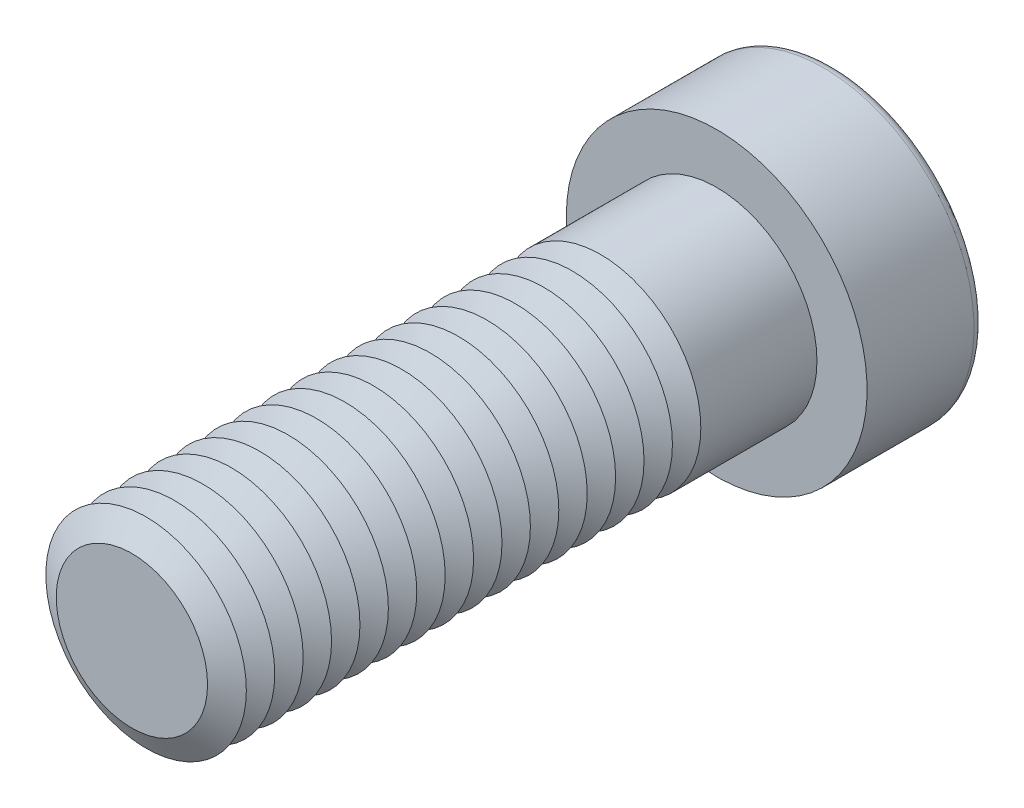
ISO-10303-21;
HEADER;
FILE_DESCRIPTION(('STEP AP214'),'2;1');
FILE_NAME('part.step','',(''),(''),'','','');
FILE_SCHEMA(('AUTOMOTIVE_DESIGN { 1 0 10303 214 1 1 1 1 }'));
ENDSEC;
DATA;
#1=APPLICATION_CONTEXT('core data for automotive mechanical design processes');
#2=APPLICATION_PROTOCOL_DEFINITION('international standard','automotive_design',2000,#1);
#3=PRODUCT_CONTEXT('',#1,'mechanical');
#4=PRODUCT('Part','Part','',(#3));
#5=PRODUCT_RELATED_PRODUCT_CATEGORY('part','',(#4));
#6=PRODUCT_DEFINITION_FORMATION('','',#4);
#7=PRODUCT_DEFINITION_CONTEXT('part definition',#1,'design');
#8=PRODUCT_DEFINITION('design','',#6,#7);
#9=PRODUCT_DEFINITION_SHAPE('','',#8);
#10=(LENGTH_UNIT() NAMED_UNIT(*) SI_UNIT(.MILLI.,.METRE.));
#11=(NAMED_UNIT(*) PLANE_ANGLE_UNIT() SI_UNIT($,.RADIAN.));
#12=(NAMED_UNIT(*) SI_UNIT($,.STERADIAN.) SOLID_ANGLE_UNIT());
#13=UNCERTAINTY_MEASURE_WITH_UNIT(LENGTH_MEASURE(1.E-05),#10,'distance_accuracy_value','');
#14=(GEOMETRIC_REPRESENTATION_CONTEXT(3) GLOBAL_UNCERTAINTY_ASSIGNED_CONTEXT((#13)) GLOBAL_UNIT_ASSIGNED_CONTEXT((#10,
#11,#12)) REPRESENTATION_CONTEXT('',''));
#15=CARTESIAN_POINT('',(0.,0.,0.));
#16=DIRECTION('',(0.,0.,1.));
#17=DIRECTION('',(1.,0.,0.));
#18=AXIS2_PLACEMENT_3D('',#15,#16,#17);
#19=CARTESIAN_POINT('',(0.,0.,29.05));
#20=DIRECTION('',(0.,0.,1.));
#21=DIRECTION('',(1.,0.,0.));
#22=AXIS2_PLACEMENT_3D('',#19,#20,#21);
#23=CONICAL_SURFACE('',#22,6.,1.0471975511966);
#24=CARTESIAN_POINT('',(0.,0.,28.2));
#25=DIRECTION('',(0.,0.,1.));
#26=DIRECTION('',(1.,0.,0.));
#27=AXIS2_PLACEMENT_3D('',#24,#25,#26);
#28=CIRCLE('',#27,4.52775681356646);
#29=CARTESIAN_POINT('',(4.52775681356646,0.,28.2));
#30=VERTEX_POINT('',#29);
#31=EDGE_CURVE('E313',#30,#30,#28,.T.);
#32=ORIENTED_EDGE('',*,*,#31,.T.);
#33=EDGE_LOOP('',(#32));
#34=FACE_BOUND('',#33,.T.);
#35=CARTESIAN_POINT('',(0.,0.,29.05));
#36=DIRECTION('',(0.,0.,1.));
#37=DIRECTION('',(1.,0.,0.));
#38=AXIS2_PLACEMENT_3D('',#35,#36,#37);
#39=CIRCLE('',#38,6.);
#40=CARTESIAN_POINT('',(6.,0.,29.05));
#41=VERTEX_POINT('',#40);
#42=EDGE_CURVE('E316',#41,#41,#39,.T.);
#43=ORIENTED_EDGE('',*,*,#42,.F.);
#44=EDGE_LOOP('',(#43));
#45=FACE_BOUND('',#44,.T.);
#46=ADVANCED_FACE('F39',(#34,#45),#23,.T.);
#47=CARTESIAN_POINT('',(0.,0.,28.2));
#48=DIRECTION('',(0.,0.,-1.));
#49=DIRECTION('',(-1.,0.,0.));
#50=AXIS2_PLACEMENT_3D('',#47,#48,#49);
#51=CONICAL_SURFACE('',#50,4.52775681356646,1.0471975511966);
#52=CARTESIAN_POINT('',(0.,0.,27.35));
#53=DIRECTION('',(0.,0.,1.));
#54=DIRECTION('',(1.,0.,0.));
#55=AXIS2_PLACEMENT_3D('',#52,#53,#54);
#56=CIRCLE('',#55,6.);
#57=CARTESIAN_POINT('',(6.,0.,27.35));
#58=VERTEX_POINT('',#57);
#59=EDGE_CURVE('E324',#58,#58,#56,.T.);
#60=ORIENTED_EDGE('',*,*,#59,.T.);
#61=EDGE_LOOP('',(#60));
#62=FACE_BOUND('',#61,.T.);
#63=ORIENTED_EDGE('',*,*,#31,.F.);
#64=EDGE_LOOP('',(#63));
#65=FACE_BOUND('',#64,.T.);
#66=ADVANCED_FACE('F245',(#62,#65),#51,.T.);
#67=CARTESIAN_POINT('',(0.,0.,35.));
#68=DIRECTION('',(0.,0.,1.));
#69=DIRECTION('',(1.,0.,0.));
#70=AXIS2_PLACEMENT_3D('',#67,#68,#69);
#71=PLANE('',#70);
#72=CARTESIAN_POINT('',(0.,0.,35.));
#73=DIRECTION('',(0.,0.,1.));
#74=DIRECTION('',(1.,0.,0.));
#75=AXIS2_PLACEMENT_3D('',#72,#73,#74);
#76=CIRCLE('',#75,4.52775681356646);
#77=CARTESIAN_POINT('',(4.52775681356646,0.,35.));
#78=VERTEX_POINT('',#77);
#79=EDGE_CURVE('E174',#78,#78,#76,.T.);
#80=ORIENTED_EDGE('',*,*,#79,.T.);
#81=EDGE_LOOP('',(#80));
#82=FACE_BOUND('',#81,.T.);
#83=ADVANCED_FACE('F251',(#82),#71,.T.);
#84=CARTESIAN_POINT('',(0.,0.,35.));
#85=DIRECTION('',(0.,0.,-1.));
#86=DIRECTION('',(-1.,0.,0.));
#87=AXIS2_PLACEMENT_3D('',#84,#85,#86);
#88=CONICAL_SURFACE('',#87,4.52775681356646,1.0471975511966);
#89=CARTESIAN_POINT('',(0.,0.,34.15));
#90=DIRECTION('',(0.,0.,1.));
#91=DIRECTION('',(1.,0.,0.));
#92=AXIS2_PLACEMENT_3D('',#89,#90,#91);
#93=CIRCLE('',#92,6.);
#94=CARTESIAN_POINT('',(6.,0.,34.15));
#95=VERTEX_POINT('',#94);
#96=EDGE_CURVE('E291',#95,#95,#93,.T.);
#97=ORIENTED_EDGE('',*,*,#96,.T.);
#98=EDGE_LOOP('',(#97));
#99=FACE_BOUND('',#98,.T.);
#100=ORIENTED_EDGE('',*,*,#79,.F.);
#101=EDGE_LOOP('',(#100));
#102=FACE_BOUND('',#101,.T.);
#103=ADVANCED_FACE('F199',(#99,#102),#88,.T.);
#104=CARTESIAN_POINT('',(0.,0.,34.15));
#105=DIRECTION('',(0.,0.,1.));
#106=DIRECTION('',(1.,0.,0.));
#107=AXIS2_PLACEMENT_3D('',#104,#105,#106);
#108=CONICAL_SURFACE('',#107,6.,1.0471975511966);
#109=CARTESIAN_POINT('',(0.,0.,33.3));
#110=DIRECTION('',(0.,0.,1.));
#111=DIRECTION('',(1.,0.,0.));
#112=AXIS2_PLACEMENT_3D('',#109,#110,#111);
#113=CIRCLE('',#112,4.52775681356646);
#114=CARTESIAN_POINT('',(4.52775681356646,0.,33.3));
#115=VERTEX_POINT('',#114);
#116=EDGE_CURVE('E288',#115,#115,#113,.T.);
#117=ORIENTED_EDGE('',*,*,#116,.T.);
#118=EDGE_LOOP('',(#117));
#119=FACE_BOUND('',#118,.T.);
#120=ORIENTED_EDGE('',*,*,#96,.F.);
#121=EDGE_LOOP('',(#120));
#122=FACE_BOUND('',#121,.T.);
#123=ADVANCED_FACE('F277',(#119,#122),#108,.T.);
#124=CARTESIAN_POINT('',(0.,0.,33.3));
#125=DIRECTION('',(0.,0.,-1.));
#126=DIRECTION('',(-1.,0.,0.));
#127=AXIS2_PLACEMENT_3D('',#124,#125,#126);
#128=CONICAL_SURFACE('',#127,4.52775681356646,1.0471975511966);
#129=CARTESIAN_POINT('',(0.,0.,32.45));
#130=DIRECTION('',(0.,0.,1.));
#131=DIRECTION('',(1.,0.,0.));
#132=AXIS2_PLACEMENT_3D('',#129,#130,#131);
#133=CIRCLE('',#132,6.);
#134=CARTESIAN_POINT('',(6.,0.,32.45));
#135=VERTEX_POINT('',#134);
#136=EDGE_CURVE('E299',#135,#135,#133,.T.);
#137=ORIENTED_EDGE('',*,*,#136,.T.);
#138=EDGE_LOOP('',(#137));
#139=FACE_BOUND('',#138,.T.);
#140=ORIENTED_EDGE('',*,*,#116,.F.);
#141=EDGE_LOOP('',(#140));
#142=FACE_BOUND('',#141,.T.);
#143=ADVANCED_FACE('F274',(#139,#142),#128,.T.);
#144=CARTESIAN_POINT('',(0.,0.,32.45));
#145=DIRECTION('',(0.,0.,1.));
#146=DIRECTION('',(1.,0.,0.));
#147=AXIS2_PLACEMENT_3D('',#144,#145,#146);
#148=CONICAL_SURFACE('',#147,6.,1.0471975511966);
#149=CARTESIAN_POINT('',(0.,0.,31.6));
#150=DIRECTION('',(0.,0.,1.));
#151=DIRECTION('',(1.,0.,0.));
#152=AXIS2_PLACEMENT_3D('',#149,#150,#151);
#153=CIRCLE('',#152,4.52775681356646);
#154=CARTESIAN_POINT('',(4.52775681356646,0.,31.6));
#155=VERTEX_POINT('',#154);
#156=EDGE_CURVE('E293',#155,#155,#153,.T.);
#157=ORIENTED_EDGE('',*,*,#156,.T.);
#158=EDGE_LOOP('',(#157));
#159=FACE_BOUND('',#158,.T.);
#160=ORIENTED_EDGE('',*,*,#136,.F.);
#161=EDGE_LOOP('',(#160));
#162=FACE_BOUND('',#161,.T.);
#163=ADVANCED_FACE('F270',(#159,#162),#148,.T.);
#164=CARTESIAN_POINT('',(0.,0.,31.6));
#165=DIRECTION('',(0.,0.,-1.));
#166=DIRECTION('',(-1.,0.,0.));
#167=AXIS2_PLACEMENT_3D('',#164,#165,#166);
#168=CONICAL_SURFACE('',#167,4.52775681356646,1.0471975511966);
#169=CARTESIAN_POINT('',(0.,0.,30.75));
#170=DIRECTION('',(0.,0.,1.));
#171=DIRECTION('',(1.,0.,0.));
#172=AXIS2_PLACEMENT_3D('',#169,#170,#171);
#173=CIRCLE('',#172,6.);
#174=CARTESIAN_POINT('',(6.,0.,30.75));
#175=VERTEX_POINT('',#174);
#176=EDGE_CURVE('E309',#175,#175,#173,.T.);
#177=ORIENTED_EDGE('',*,*,#176,.T.);
#178=EDGE_LOOP('',(#177));
#179=FACE_BOUND('',#178,.T.);
#180=ORIENTED_EDGE('',*,*,#156,.F.);
#181=EDGE_LOOP('',(#180));
#182=FACE_BOUND('',#181,.T.);
#183=ADVANCED_FACE('F266',(#179,#182),#168,.T.);
#184=CARTESIAN_POINT('',(0.,0.,30.75));
#185=DIRECTION('',(0.,0.,1.));
#186=DIRECTION('',(1.,0.,0.));
#187=AXIS2_PLACEMENT_3D('',#184,#185,#186);
#188=CONICAL_SURFACE('',#187,6.,1.0471975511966);
#189=CARTESIAN_POINT('',(0.,0.,29.9));
#190=DIRECTION('',(0.,0.,1.));
#191=DIRECTION('',(1.,0.,0.));
#192=AXIS2_PLACEMENT_3D('',#189,#190,#191);
#193=CIRCLE('',#192,4.52775681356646);
#194=CARTESIAN_POINT('',(4.52775681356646,0.,29.9));
#195=VERTEX_POINT('',#194);
#196=EDGE_CURVE('E305',#195,#195,#193,.T.);
#197=ORIENTED_EDGE('',*,*,#196,.T.);
#198=EDGE_LOOP('',(#197));
#199=FACE_BOUND('',#198,.T.);
#200=ORIENTED_EDGE('',*,*,#176,.F.);
#201=EDGE_LOOP('',(#200));
#202=FACE_BOUND('',#201,.T.);
#203=ADVANCED_FACE('F262',(#199,#202),#188,.T.);
#204=CARTESIAN_POINT('',(0.,0.,29.9));
#205=DIRECTION('',(0.,0.,-1.));
#206=DIRECTION('',(-1.,0.,0.));
#207=AXIS2_PLACEMENT_3D('',#204,#205,#206);
#208=CONICAL_SURFACE('',#207,4.52775681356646,1.0471975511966);
#209=ORIENTED_EDGE('',*,*,#42,.T.);
#210=EDGE_LOOP('',(#209));
#211=FACE_BOUND('',#210,.T.);
#212=ORIENTED_EDGE('',*,*,#196,.F.);
#213=EDGE_LOOP('',(#212));
#214=FACE_BOUND('',#213,.T.);
#215=ADVANCED_FACE('F258',(#211,#214),#208,.T.);
#216=CARTESIAN_POINT('',(0.,0.,27.35));
#217=DIRECTION('',(0.,0.,1.));
#218=DIRECTION('',(1.,0.,0.));
#219=AXIS2_PLACEMENT_3D('',#216,#217,#218);
#220=CONICAL_SURFACE('',#219,6.,1.0471975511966);
#221=CARTESIAN_POINT('',(0.,0.,26.5));
#222=DIRECTION('',(0.,0.,1.));
#223=DIRECTION('',(1.,0.,0.));
#224=AXIS2_PLACEMENT_3D('',#221,#222,#223);
#225=CIRCLE('',#224,4.52775681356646);
#226=CARTESIAN_POINT('',(4.52775681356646,0.,26.5));
#227=VERTEX_POINT('',#226);
#228=EDGE_CURVE('E320',#227,#227,#225,.T.);
#229=ORIENTED_EDGE('',*,*,#228,.T.);
#230=EDGE_LOOP('',(#229));
#231=FACE_BOUND('',#230,.T.);
#232=ORIENTED_EDGE('',*,*,#59,.F.);
#233=EDGE_LOOP('',(#232));
#234=FACE_BOUND('',#233,.T.);
#235=ADVANCED_FACE('F261',(#231,#234),#220,.T.);
#236=CARTESIAN_POINT('',(0.,0.,26.5));
#237=DIRECTION('',(0.,0.,-1.));
#238=DIRECTION('',(-1.,0.,0.));
#239=AXIS2_PLACEMENT_3D('',#236,#237,#238);
#240=CONICAL_SURFACE('',#239,4.52775681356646,1.0471975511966);
#241=CARTESIAN_POINT('',(0.,0.,25.65));
#242=DIRECTION('',(0.,0.,1.));
#243=DIRECTION('',(1.,0.,0.));
#244=AXIS2_PLACEMENT_3D('',#241,#242,#243);
#245=CIRCLE('',#244,6.);
#246=CARTESIAN_POINT('',(6.,0.,25.65));
#247=VERTEX_POINT('',#246);
#248=EDGE_CURVE('E332',#247,#247,#245,.T.);
#249=ORIENTED_EDGE('',*,*,#248,.T.);
#250=EDGE_LOOP('',(#249));
#251=FACE_BOUND('',#250,.T.);
#252=ORIENTED_EDGE('',*,*,#228,.F.);
#253=EDGE_LOOP('',(#252));
#254=FACE_BOUND('',#253,.T.);
#255=ADVANCED_FACE('F511',(#251,#254),#240,.T.);
#256=CARTESIAN_POINT('',(0.,0.,25.65));
#257=DIRECTION('',(0.,0.,1.));
#258=DIRECTION('',(1.,0.,0.));
#259=AXIS2_PLACEMENT_3D('',#256,#257,#258);
#260=CONICAL_SURFACE('',#259,6.,1.0471975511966);
#261=CARTESIAN_POINT('',(0.,0.,24.8));
#262=DIRECTION('',(0.,0.,1.));
#263=DIRECTION('',(1.,0.,0.));
#264=AXIS2_PLACEMENT_3D('',#261,#262,#263);
#265=CIRCLE('',#264,4.52775681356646);
#266=CARTESIAN_POINT('',(4.52775681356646,0.,24.8));
#267=VERTEX_POINT('',#266);
#268=EDGE_CURVE('E328',#267,#267,#265,.T.);
#269=ORIENTED_EDGE('',*,*,#268,.T.);
#270=EDGE_LOOP('',(#269));
#271=FACE_BOUND('',#270,.T.);
#272=ORIENTED_EDGE('',*,*,#248,.F.);
#273=EDGE_LOOP('',(#272));
#274=FACE_BOUND('',#273,.T.);
#275=ADVANCED_FACE('F507',(#271,#274),#260,.T.);
#276=CARTESIAN_POINT('',(0.,0.,24.8));
#277=DIRECTION('',(0.,0.,-1.));
#278=DIRECTION('',(-1.,0.,0.));
#279=AXIS2_PLACEMENT_3D('',#276,#277,#278);
#280=CONICAL_SURFACE('',#279,4.52775681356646,1.0471975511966);
#281=CARTESIAN_POINT('',(0.,0.,23.95));
#282=DIRECTION('',(0.,0.,1.));
#283=DIRECTION('',(1.,0.,0.));
#284=AXIS2_PLACEMENT_3D('',#281,#282,#283);
#285=CIRCLE('',#284,6.);
#286=CARTESIAN_POINT('',(6.,0.,23.95));
#287=VERTEX_POINT('',#286);
#288=EDGE_CURVE('E340',#287,#287,#285,.T.);
#289=ORIENTED_EDGE('',*,*,#288,.T.);
#290=EDGE_LOOP('',(#289));
#291=FACE_BOUND('',#290,.T.);
#292=ORIENTED_EDGE('',*,*,#268,.F.);
#293=EDGE_LOOP('',(#292));
#294=FACE_BOUND('',#293,.T.);
#295=ADVANCED_FACE('F503',(#291,#294),#280,.T.);
#296=CARTESIAN_POINT('',(0.,0.,23.95));
#297=DIRECTION('',(0.,0.,1.));
#298=DIRECTION('',(1.,0.,0.));
#299=AXIS2_PLACEMENT_3D('',#296,#297,#298);
#300=CONICAL_SURFACE('',#299,6.,1.0471975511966);
#301=CARTESIAN_POINT('',(0.,0.,23.1));
#302=DIRECTION('',(0.,0.,1.));
#303=DIRECTION('',(1.,0.,0.));
#304=AXIS2_PLACEMENT_3D('',#301,#302,#303);
#305=CIRCLE('',#304,4.52775681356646);
#306=CARTESIAN_POINT('',(4.52775681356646,0.,23.1));
#307=VERTEX_POINT('',#306);
#308=EDGE_CURVE('E336',#307,#307,#305,.T.);
#309=ORIENTED_EDGE('',*,*,#308,.T.);
#310=EDGE_LOOP('',(#309));
#311=FACE_BOUND('',#310,.T.);
#312=ORIENTED_EDGE('',*,*,#288,.F.);
#313=EDGE_LOOP('',(#312));
#314=FACE_BOUND('',#313,.T.);
#315=ADVANCED_FACE('F499',(#311,#314),#300,.T.);
#316=CARTESIAN_POINT('',(0.,0.,23.1));
#317=DIRECTION('',(0.,0.,-1.));
#318=DIRECTION('',(-1.,0.,0.));
#319=AXIS2_PLACEMENT_3D('',#316,#317,#318);
#320=CONICAL_SURFACE('',#319,4.52775681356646,1.0471975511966);
#321=CARTESIAN_POINT('',(0.,0.,22.25));
#322=DIRECTION('',(0.,0.,1.));
#323=DIRECTION('',(1.,0.,0.));
#324=AXIS2_PLACEMENT_3D('',#321,#322,#323);
#325=CIRCLE('',#324,6.);
#326=CARTESIAN_POINT('',(6.,0.,22.25));
#327=VERTEX_POINT('',#326);
#328=EDGE_CURVE('E348',#327,#327,#325,.T.);
#329=ORIENTED_EDGE('',*,*,#328,.T.);
#330=EDGE_LOOP('',(#329));
#331=FACE_BOUND('',#330,.T.);
#332=ORIENTED_EDGE('',*,*,#308,.F.);
#333=EDGE_LOOP('',(#332));
#334=FACE_BOUND('',#333,.T.);
#335=ADVANCED_FACE('F495',(#331,#334),#320,.T.);
#336=CARTESIAN_POINT('',(0.,0.,22.25));
#337=DIRECTION('',(0.,0.,1.));
#338=DIRECTION('',(1.,0.,0.));
#339=AXIS2_PLACEMENT_3D('',#336,#337,#338);
#340=CONICAL_SURFACE('',#339,6.,1.0471975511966);
#341=CARTESIAN_POINT('',(0.,0.,21.4));
#342=DIRECTION('',(0.,0.,1.));
#343=DIRECTION('',(1.,0.,0.));
#344=AXIS2_PLACEMENT_3D('',#341,#342,#343);
#345=CIRCLE('',#344,4.52775681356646);
#346=CARTESIAN_POINT('',(4.52775681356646,0.,21.4));
#347=VERTEX_POINT('',#346);
#348=EDGE_CURVE('E344',#347,#347,#345,.T.);
#349=ORIENTED_EDGE('',*,*,#348,.T.);
#350=EDGE_LOOP('',(#349));
#351=FACE_BOUND('',#350,.T.);
#352=ORIENTED_EDGE('',*,*,#328,.F.);
#353=EDGE_LOOP('',(#352));
#354=FACE_BOUND('',#353,.T.);
#355=ADVANCED_FACE('F491',(#351,#354),#340,.T.);
#356=CARTESIAN_POINT('',(0.,0.,21.4));
#357=DIRECTION('',(0.,0.,-1.));
#358=DIRECTION('',(-1.,0.,0.));
#359=AXIS2_PLACEMENT_3D('',#356,#357,#358);
#360=CONICAL_SURFACE('',#359,4.52775681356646,1.0471975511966);
#361=CARTESIAN_POINT('',(0.,0.,20.55));
#362=DIRECTION('',(0.,0.,1.));
#363=DIRECTION('',(1.,0.,0.));
#364=AXIS2_PLACEMENT_3D('',#361,#362,#363);
#365=CIRCLE('',#364,6.);
#366=CARTESIAN_POINT('',(6.,0.,20.55));
#367=VERTEX_POINT('',#366);
#368=EDGE_CURVE('E356',#367,#367,#365,.T.);
#369=ORIENTED_EDGE('',*,*,#368,.T.);
#370=EDGE_LOOP('',(#369));
#371=FACE_BOUND('',#370,.T.);
#372=ORIENTED_EDGE('',*,*,#348,.F.);
#373=EDGE_LOOP('',(#372));
#374=FACE_BOUND('',#373,.T.);
#375=ADVANCED_FACE('F487',(#371,#374),#360,.T.);
#376=CARTESIAN_POINT('',(0.,0.,20.55));
#377=DIRECTION('',(0.,0.,1.));
#378=DIRECTION('',(1.,0.,0.));
#379=AXIS2_PLACEMENT_3D('',#376,#377,#378);
#380=CONICAL_SURFACE('',#379,6.,1.0471975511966);
#381=CARTESIAN_POINT('',(0.,0.,19.7));
#382=DIRECTION('',(0.,0.,1.));
#383=DIRECTION('',(1.,0.,0.));
#384=AXIS2_PLACEMENT_3D('',#381,#382,#383);
#385=CIRCLE('',#384,4.52775681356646);
#386=CARTESIAN_POINT('',(4.52775681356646,0.,19.7));
#387=VERTEX_POINT('',#386);
#388=EDGE_CURVE('E352',#387,#387,#385,.T.);
#389=ORIENTED_EDGE('',*,*,#388,.T.);
#390=EDGE_LOOP('',(#389));
#391=FACE_BOUND('',#390,.T.);
#392=ORIENTED_EDGE('',*,*,#368,.F.);
#393=EDGE_LOOP('',(#392));
#394=FACE_BOUND('',#393,.T.);
#395=ADVANCED_FACE('F483',(#391,#394),#380,.T.);
#396=CARTESIAN_POINT('',(0.,0.,19.7));
#397=DIRECTION('',(0.,0.,-1.));
#398=DIRECTION('',(-1.,0.,0.));
#399=AXIS2_PLACEMENT_3D('',#396,#397,#398);
#400=CONICAL_SURFACE('',#399,4.52775681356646,1.0471975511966);
#401=CARTESIAN_POINT('',(0.,0.,18.85));
#402=DIRECTION('',(0.,0.,1.));
#403=DIRECTION('',(1.,0.,0.));
#404=AXIS2_PLACEMENT_3D('',#401,#402,#403);
#405=CIRCLE('',#404,6.);
#406=CARTESIAN_POINT('',(6.,0.,18.85));
#407=VERTEX_POINT('',#406);
#408=EDGE_CURVE('E364',#407,#407,#405,.T.);
#409=ORIENTED_EDGE('',*,*,#408,.T.);
#410=EDGE_LOOP('',(#409));
#411=FACE_BOUND('',#410,.T.);
#412=ORIENTED_EDGE('',*,*,#388,.F.);
#413=EDGE_LOOP('',(#412));
#414=FACE_BOUND('',#413,.T.);
#415=ADVANCED_FACE('F479',(#411,#414),#400,.T.);
#416=CARTESIAN_POINT('',(0.,0.,18.85));
#417=DIRECTION('',(0.,0.,1.));
#418=DIRECTION('',(1.,0.,0.));
#419=AXIS2_PLACEMENT_3D('',#416,#417,#418);
#420=CONICAL_SURFACE('',#419,6.,1.0471975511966);
#421=CARTESIAN_POINT('',(0.,0.,18.));
#422=DIRECTION('',(0.,0.,1.));
#423=DIRECTION('',(1.,0.,0.));
#424=AXIS2_PLACEMENT_3D('',#421,#422,#423);
#425=CIRCLE('',#424,4.52775681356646);
#426=CARTESIAN_POINT('',(4.52775681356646,0.,18.));
#427=VERTEX_POINT('',#426);
#428=EDGE_CURVE('E360',#427,#427,#425,.T.);
#429=ORIENTED_EDGE('',*,*,#428,.T.);
#430=EDGE_LOOP('',(#429));
#431=FACE_BOUND('',#430,.T.);
#432=ORIENTED_EDGE('',*,*,#408,.F.);
#433=EDGE_LOOP('',(#432));
#434=FACE_BOUND('',#433,.T.);
#435=ADVANCED_FACE('F475',(#431,#434),#420,.T.);
#436=CARTESIAN_POINT('',(0.,0.,18.));
#437=DIRECTION('',(0.,0.,-1.));
#438=DIRECTION('',(-1.,0.,0.));
#439=AXIS2_PLACEMENT_3D('',#436,#437,#438);
#440=CONICAL_SURFACE('',#439,4.52775681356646,1.0471975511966);
#441=CARTESIAN_POINT('',(0.,0.,17.15));
#442=DIRECTION('',(0.,0.,1.));
#443=DIRECTION('',(1.,0.,0.));
#444=AXIS2_PLACEMENT_3D('',#441,#442,#443);
#445=CIRCLE('',#444,6.);
#446=CARTESIAN_POINT('',(6.,0.,17.15));
#447=VERTEX_POINT('',#446);
#448=EDGE_CURVE('E372',#447,#447,#445,.T.);
#449=ORIENTED_EDGE('',*,*,#448,.T.);
#450=EDGE_LOOP('',(#449));
#451=FACE_BOUND('',#450,.T.);
#452=ORIENTED_EDGE('',*,*,#428,.F.);
#453=EDGE_LOOP('',(#452));
#454=FACE_BOUND('',#453,.T.);
#455=ADVANCED_FACE('F471',(#451,#454),#440,.T.);
#456=CARTESIAN_POINT('',(0.,0.,17.15));
#457=DIRECTION('',(0.,0.,1.));
#458=DIRECTION('',(1.,0.,0.));
#459=AXIS2_PLACEMENT_3D('',#456,#457,#458);
#460=CONICAL_SURFACE('',#459,6.,1.0471975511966);
#461=CARTESIAN_POINT('',(0.,0.,16.3));
#462=DIRECTION('',(0.,0.,1.));
#463=DIRECTION('',(1.,0.,0.));
#464=AXIS2_PLACEMENT_3D('',#461,#462,#463);
#465=CIRCLE('',#464,4.52775681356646);
#466=CARTESIAN_POINT('',(4.52775681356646,0.,16.3));
#467=VERTEX_POINT('',#466);
#468=EDGE_CURVE('E368',#467,#467,#465,.T.);
#469=ORIENTED_EDGE('',*,*,#468,.T.);
#470=EDGE_LOOP('',(#469));
#471=FACE_BOUND('',#470,.T.);
#472=ORIENTED_EDGE('',*,*,#448,.F.);
#473=EDGE_LOOP('',(#472));
#474=FACE_BOUND('',#473,.T.);
#475=ADVANCED_FACE('F467',(#471,#474),#460,.T.);
#476=CARTESIAN_POINT('',(0.,0.,16.3));
#477=DIRECTION('',(0.,0.,-1.));
#478=DIRECTION('',(-1.,0.,0.));
#479=AXIS2_PLACEMENT_3D('',#476,#477,#478);
#480=CONICAL_SURFACE('',#479,4.52775681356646,1.0471975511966);
#481=CARTESIAN_POINT('',(0.,0.,15.45));
#482=DIRECTION('',(0.,0.,1.));
#483=DIRECTION('',(1.,0.,0.));
#484=AXIS2_PLACEMENT_3D('',#481,#482,#483);
#485=CIRCLE('',#484,6.);
#486=CARTESIAN_POINT('',(6.,0.,15.45));
#487=VERTEX_POINT('',#486);
#488=EDGE_CURVE('E380',#487,#487,#485,.T.);
#489=ORIENTED_EDGE('',*,*,#488,.T.);
#490=EDGE_LOOP('',(#489));
#491=FACE_BOUND('',#490,.T.);
#492=ORIENTED_EDGE('',*,*,#468,.F.);
#493=EDGE_LOOP('',(#492));
#494=FACE_BOUND('',#493,.T.);
#495=ADVANCED_FACE('F463',(#491,#494),#480,.T.);
#496=CARTESIAN_POINT('',(0.,0.,15.45));
#497=DIRECTION('',(0.,0.,1.));
#498=DIRECTION('',(1.,0.,0.));
#499=AXIS2_PLACEMENT_3D('',#496,#497,#498);
#500=CONICAL_SURFACE('',#499,6.,1.0471975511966);
#501=CARTESIAN_POINT('',(0.,0.,14.6));
#502=DIRECTION('',(0.,0.,1.));
#503=DIRECTION('',(1.,0.,0.));
#504=AXIS2_PLACEMENT_3D('',#501,#502,#503);
#505=CIRCLE('',#504,4.52775681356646);
#506=CARTESIAN_POINT('',(4.52775681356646,0.,14.6));
#507=VERTEX_POINT('',#506);
#508=EDGE_CURVE('E376',#507,#507,#505,.T.);
#509=ORIENTED_EDGE('',*,*,#508,.T.);
#510=EDGE_LOOP('',(#509));
#511=FACE_BOUND('',#510,.T.);
#512=ORIENTED_EDGE('',*,*,#488,.F.);
#513=EDGE_LOOP('',(#512));
#514=FACE_BOUND('',#513,.T.);
#515=ADVANCED_FACE('F459',(#511,#514),#500,.T.);
#516=CARTESIAN_POINT('',(0.,0.,14.6));
#517=DIRECTION('',(0.,0.,-1.));
#518=DIRECTION('',(-1.,0.,0.));
#519=AXIS2_PLACEMENT_3D('',#516,#517,#518);
#520=CONICAL_SURFACE('',#519,4.52775681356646,1.0471975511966);
#521=CARTESIAN_POINT('',(0.,0.,13.75));
#522=DIRECTION('',(0.,0.,1.));
#523=DIRECTION('',(1.,0.,0.));
#524=AXIS2_PLACEMENT_3D('',#521,#522,#523);
#525=CIRCLE('',#524,6.);
#526=CARTESIAN_POINT('',(6.,0.,13.75));
#527=VERTEX_POINT('',#526);
#528=EDGE_CURVE('E388',#527,#527,#525,.T.);
#529=ORIENTED_EDGE('',*,*,#528,.T.);
#530=EDGE_LOOP('',(#529));
#531=FACE_BOUND('',#530,.T.);
#532=ORIENTED_EDGE('',*,*,#508,.F.);
#533=EDGE_LOOP('',(#532));
#534=FACE_BOUND('',#533,.T.);
#535=ADVANCED_FACE('F455',(#531,#534),#520,.T.);
#536=CARTESIAN_POINT('',(0.,0.,13.75));
#537=DIRECTION('',(0.,0.,1.));
#538=DIRECTION('',(1.,0.,0.));
#539=AXIS2_PLACEMENT_3D('',#536,#537,#538);
#540=CONICAL_SURFACE('',#539,6.,1.0471975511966);
#541=CARTESIAN_POINT('',(0.,0.,12.9));
#542=DIRECTION('',(0.,0.,1.));
#543=DIRECTION('',(1.,0.,0.));
#544=AXIS2_PLACEMENT_3D('',#541,#542,#543);
#545=CIRCLE('',#544,4.52775681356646);
#546=CARTESIAN_POINT('',(4.52775681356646,0.,12.9));
#547=VERTEX_POINT('',#546);
#548=EDGE_CURVE('E384',#547,#547,#545,.T.);
#549=ORIENTED_EDGE('',*,*,#548,.T.);
#550=EDGE_LOOP('',(#549));
#551=FACE_BOUND('',#550,.T.);
#552=ORIENTED_EDGE('',*,*,#528,.F.);
#553=EDGE_LOOP('',(#552));
#554=FACE_BOUND('',#553,.T.);
#555=ADVANCED_FACE('F451',(#551,#554),#540,.T.);
#556=CARTESIAN_POINT('',(0.,0.,12.9));
#557=DIRECTION('',(0.,0.,-1.));
#558=DIRECTION('',(-1.,0.,0.));
#559=AXIS2_PLACEMENT_3D('',#556,#557,#558);
#560=CONICAL_SURFACE('',#559,4.52775681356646,1.0471975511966);
#561=CARTESIAN_POINT('',(0.,0.,12.05));
#562=DIRECTION('',(0.,0.,1.));
#563=DIRECTION('',(1.,0.,0.));
#564=AXIS2_PLACEMENT_3D('',#561,#562,#563);
#565=CIRCLE('',#564,6.);
#566=CARTESIAN_POINT('',(6.,0.,12.05));
#567=VERTEX_POINT('',#566);
#568=EDGE_CURVE('E395',#567,#567,#565,.T.);
#569=ORIENTED_EDGE('',*,*,#568,.T.);
#570=EDGE_LOOP('',(#569));
#571=FACE_BOUND('',#570,.T.);
#572=ORIENTED_EDGE('',*,*,#548,.F.);
#573=EDGE_LOOP('',(#572));
#574=FACE_BOUND('',#573,.T.);
#575=ADVANCED_FACE('F447',(#571,#574),#560,.T.);
#576=CARTESIAN_POINT('',(0.,0.,12.05));
#577=DIRECTION('',(0.,0.,1.));
#578=DIRECTION('',(1.,0.,0.));
#579=AXIS2_PLACEMENT_3D('',#576,#577,#578);
#580=CONICAL_SURFACE('',#579,6.,1.0471975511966);
#581=CARTESIAN_POINT('',(0.,0.,11.2));
#582=DIRECTION('',(0.,0.,1.));
#583=DIRECTION('',(1.,0.,0.));
#584=AXIS2_PLACEMENT_3D('',#581,#582,#583);
#585=CIRCLE('',#584,4.52775681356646);
#586=CARTESIAN_POINT('',(4.52775681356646,0.,11.2));
#587=VERTEX_POINT('',#586);
#588=EDGE_CURVE('E392',#587,#587,#585,.T.);
#589=ORIENTED_EDGE('',*,*,#588,.T.);
#590=EDGE_LOOP('',(#589));
#591=FACE_BOUND('',#590,.T.);
#592=ORIENTED_EDGE('',*,*,#568,.F.);
#593=EDGE_LOOP('',(#592));
#594=FACE_BOUND('',#593,.T.);
#595=ADVANCED_FACE('F443',(#591,#594),#580,.T.);
#596=CARTESIAN_POINT('',(0.,0.,11.2));
#597=DIRECTION('',(0.,0.,-1.));
#598=DIRECTION('',(-1.,0.,0.));
#599=AXIS2_PLACEMENT_3D('',#596,#597,#598);
#600=CONICAL_SURFACE('',#599,4.52775681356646,1.0471975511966);
#601=CARTESIAN_POINT('',(0.,0.,10.35));
#602=DIRECTION('',(0.,0.,1.));
#603=DIRECTION('',(1.,0.,0.));
#604=AXIS2_PLACEMENT_3D('',#601,#602,#603);
#605=CIRCLE('',#604,6.);
#606=CARTESIAN_POINT('',(6.,0.,10.35));
#607=VERTEX_POINT('',#606);
#608=EDGE_CURVE('E403',#607,#607,#605,.T.);
#609=ORIENTED_EDGE('',*,*,#608,.T.);
#610=EDGE_LOOP('',(#609));
#611=FACE_BOUND('',#610,.T.);
#612=ORIENTED_EDGE('',*,*,#588,.F.);
#613=EDGE_LOOP('',(#612));
#614=FACE_BOUND('',#613,.T.);
#615=ADVANCED_FACE('F439',(#611,#614),#600,.T.);
#616=CARTESIAN_POINT('',(0.,0.,10.35));
#617=DIRECTION('',(0.,0.,1.));
#618=DIRECTION('',(1.,0.,0.));
#619=AXIS2_PLACEMENT_3D('',#616,#617,#618);
#620=CONICAL_SURFACE('',#619,6.,1.0471975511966);
#621=CARTESIAN_POINT('',(0.,0.,9.50000000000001));
#622=DIRECTION('',(0.,0.,1.));
#623=DIRECTION('',(1.,0.,0.));
#624=AXIS2_PLACEMENT_3D('',#621,#622,#623);
#625=CIRCLE('',#624,4.52775681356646);
#626=CARTESIAN_POINT('',(4.52775681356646,0.,9.50000000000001));
#627=VERTEX_POINT('',#626);
#628=EDGE_CURVE('E399',#627,#627,#625,.T.);
#629=ORIENTED_EDGE('',*,*,#628,.T.);
#630=EDGE_LOOP('',(#629));
#631=FACE_BOUND('',#630,.T.);
#632=ORIENTED_EDGE('',*,*,#608,.F.);
#633=EDGE_LOOP('',(#632));
#634=FACE_BOUND('',#633,.T.);
#635=ADVANCED_FACE('F434',(#631,#634),#620,.T.);
#636=CARTESIAN_POINT('',(0.,0.,9.50000000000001));
#637=DIRECTION('',(0.,0.,-1.));
#638=DIRECTION('',(-1.,0.,0.));
#639=AXIS2_PLACEMENT_3D('',#636,#637,#638);
#640=CONICAL_SURFACE('',#639,4.52775681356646,1.0471975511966);
#641=CARTESIAN_POINT('',(0.,0.,8.65000000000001));
#642=DIRECTION('',(0.,0.,1.));
#643=DIRECTION('',(1.,0.,0.));
#644=AXIS2_PLACEMENT_3D('',#641,#642,#643);
#645=CIRCLE('',#644,6.);
#646=CARTESIAN_POINT('',(6.,0.,8.65000000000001));
#647=VERTEX_POINT('',#646);
#648=EDGE_CURVE('E415',#647,#647,#645,.T.);
#649=ORIENTED_EDGE('',*,*,#648,.T.);
#650=EDGE_LOOP('',(#649));
#651=FACE_BOUND('',#650,.T.);
#652=ORIENTED_EDGE('',*,*,#628,.F.);
#653=EDGE_LOOP('',(#652));
#654=FACE_BOUND('',#653,.T.);
#655=ADVANCED_FACE('F420',(#651,#654),#640,.T.);
#656=CARTESIAN_POINT('',(0.,0.,8.65000000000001));
#657=DIRECTION('',(0.,0.,1.));
#658=DIRECTION('',(1.,0.,0.));
#659=AXIS2_PLACEMENT_3D('',#656,#657,#658);
#660=CONICAL_SURFACE('',#659,6.,1.0471975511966);
#661=CARTESIAN_POINT('',(0.,0.,7.80000000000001));
#662=DIRECTION('',(0.,0.,1.));
#663=DIRECTION('',(1.,0.,0.));
#664=AXIS2_PLACEMENT_3D('',#661,#662,#663);
#665=CIRCLE('',#664,4.52775681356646);
#666=CARTESIAN_POINT('',(4.52775681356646,0.,7.80000000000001));
#667=VERTEX_POINT('',#666);
#668=EDGE_CURVE('E407',#667,#667,#665,.T.);
#669=ORIENTED_EDGE('',*,*,#668,.T.);
#670=EDGE_LOOP('',(#669));
#671=FACE_BOUND('',#670,.T.);
#672=ORIENTED_EDGE('',*,*,#648,.F.);
#673=EDGE_LOOP('',(#672));
#674=FACE_BOUND('',#673,.T.);
#675=ADVANCED_FACE('F423',(#671,#674),#660,.T.);
#676=CARTESIAN_POINT('',(0.,0.,7.80000000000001));
#677=DIRECTION('',(0.,0.,-1.));
#678=DIRECTION('',(-1.,0.,0.));
#679=AXIS2_PLACEMENT_3D('',#676,#677,#678);
#680=CONICAL_SURFACE('',#679,4.52775681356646,1.0471975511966);
#681=CARTESIAN_POINT('',(0.,0.,6.95));
#682=DIRECTION('',(0.,0.,1.));
#683=DIRECTION('',(1.,0.,0.));
#684=AXIS2_PLACEMENT_3D('',#681,#682,#683);
#685=CIRCLE('',#684,6.);
#686=CARTESIAN_POINT('',(6.,0.,6.95));
#687=VERTEX_POINT('',#686);
#688=EDGE_CURVE('E411',#687,#687,#685,.T.);
#689=ORIENTED_EDGE('',*,*,#688,.T.);
#690=EDGE_LOOP('',(#689));
#691=FACE_BOUND('',#690,.T.);
#692=ORIENTED_EDGE('',*,*,#668,.F.);
#693=EDGE_LOOP('',(#692));
#694=FACE_BOUND('',#693,.T.);
#695=ADVANCED_FACE('F425',(#691,#694),#680,.T.);
#696=CARTESIAN_POINT('',(0.,0.,-1.));
#697=DIRECTION('',(0.,0.,-1.));
#698=DIRECTION('',(-1.,0.,0.));
#699=AXIS2_PLACEMENT_3D('',#696,#697,#698);
#700=CONICAL_SURFACE('',#699,4.,1.0471975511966);
#701=CARTESIAN_POINT('',(0.,0.,1.30940107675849));
#702=VERTEX_POINT('',#701);
#703=VERTEX_LOOP('',#702);
#704=FACE_BOUND('',#703,.T.);
#705=CARTESIAN_POINT('',(0.,0.,-1.));
#706=DIRECTION('',(0.,0.,-1.));
#707=DIRECTION('',(-1.,0.,0.));
#708=AXIS2_PLACEMENT_3D('',#705,#706,#707);
#709=CIRCLE('',#708,4.);
#710=CARTESIAN_POINT('',(-3.46410161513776,2.,-1.));
#711=VERTEX_POINT('',#710);
#712=CARTESIAN_POINT('',(0.,4.,-1.));
#713=VERTEX_POINT('',#712);
#714=EDGE_CURVE('E149',#711,#713,#709,.T.);
#715=ORIENTED_EDGE('',*,*,#714,.T.);
#716=CARTESIAN_POINT('',(0.,0.,-1.));
#717=DIRECTION('',(0.,0.,-1.));
#718=DIRECTION('',(-1.,0.,0.));
#719=AXIS2_PLACEMENT_3D('',#716,#717,#718);
#720=CIRCLE('',#719,4.);
#721=CARTESIAN_POINT('',(3.46410161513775,2.,-1.));
#722=VERTEX_POINT('',#721);
#723=EDGE_CURVE('E54',#713,#722,#720,.T.);
#724=ORIENTED_EDGE('',*,*,#723,.T.);
#725=CARTESIAN_POINT('',(3.46410161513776,-2.,-1.));
#726=VERTEX_POINT('',#725);
#727=EDGE_CURVE('E1026',#722,#726,#720,.T.);
#728=ORIENTED_EDGE('',*,*,#727,.T.);
#729=CARTESIAN_POINT('',(0.,-4.,-1.));
#730=VERTEX_POINT('',#729);
#731=EDGE_CURVE('E1024',#726,#730,#720,.T.);
#732=ORIENTED_EDGE('',*,*,#731,.T.);
#733=CARTESIAN_POINT('',(-3.46410161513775,-2.,-1.));
#734=VERTEX_POINT('',#733);
#735=EDGE_CURVE('E1020',#730,#734,#720,.T.);
#736=ORIENTED_EDGE('',*,*,#735,.T.);
#737=EDGE_CURVE('E1018',#734,#711,#720,.T.);
#738=ORIENTED_EDGE('',*,*,#737,.T.);
#739=EDGE_LOOP('',(#715,#724,#728,#732,#736,#738));
#740=FACE_BOUND('',#739,.T.);
#741=ADVANCED_FACE('F201',(#704,#740),#700,.F.);
#742=CARTESIAN_POINT('',(0.,0.,-1.));
#743=DIRECTION('',(0.,0.,-1.));
#744=DIRECTION('',(-1.,0.,0.));
#745=AXIS2_PLACEMENT_3D('',#742,#743,#744);
#746=PLANE('',#745);
#747=ORIENTED_EDGE('',*,*,#723,.F.);
#748=DIRECTION('',(1.,0.,0.));
#749=VECTOR('',#748,1.);
#750=CARTESIAN_POINT('',(-2.3094010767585,4.,-1.));
#751=LINE('',#750,#749);
#752=CARTESIAN_POINT('',(2.3094010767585,4.,-1.));
#753=VERTEX_POINT('',#752);
#754=EDGE_CURVE('E1062',#713,#753,#751,.T.);
#755=ORIENTED_EDGE('',*,*,#754,.T.);
#756=DIRECTION('',(0.5,-0.866025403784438,0.));
#757=VECTOR('',#756,1.);
#758=CARTESIAN_POINT('',(2.3094010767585,4.,-1.));
#759=LINE('',#758,#757);
#760=EDGE_CURVE('E155',#753,#722,#759,.T.);
#761=ORIENTED_EDGE('',*,*,#760,.T.);
#762=EDGE_LOOP('',(#747,#755,#761));
#763=FACE_BOUND('',#762,.T.);
#764=ADVANCED_FACE('F606',(#763),#746,.T.);
#765=ORIENTED_EDGE('',*,*,#727,.F.);
#766=CARTESIAN_POINT('',(4.61880215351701,0.,-1.));
#767=VERTEX_POINT('',#766);
#768=EDGE_CURVE('E1067',#722,#767,#759,.T.);
#769=ORIENTED_EDGE('',*,*,#768,.T.);
#770=DIRECTION('',(-0.5,-0.866025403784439,0.));
#771=VECTOR('',#770,1.);
#772=CARTESIAN_POINT('',(4.61880215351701,0.,-1.));
#773=LINE('',#772,#771);
#774=EDGE_CURVE('E1039',#767,#726,#773,.T.);
#775=ORIENTED_EDGE('',*,*,#774,.T.);
#776=EDGE_LOOP('',(#765,#769,#775));
#777=FACE_BOUND('',#776,.T.);
#778=ADVANCED_FACE('F616',(#777),#746,.T.);
#779=ORIENTED_EDGE('',*,*,#731,.F.);
#780=CARTESIAN_POINT('',(2.3094010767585,-4.,-1.));
#781=VERTEX_POINT('',#780);
#782=EDGE_CURVE('E1041',#726,#781,#773,.T.);
#783=ORIENTED_EDGE('',*,*,#782,.T.);
#784=DIRECTION('',(-1.,0.,0.));
#785=VECTOR('',#784,1.);
#786=CARTESIAN_POINT('',(2.3094010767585,-4.,-1.));
#787=LINE('',#786,#785);
#788=EDGE_CURVE('E991',#781,#730,#787,.T.);
#789=ORIENTED_EDGE('',*,*,#788,.T.);
#790=EDGE_LOOP('',(#779,#783,#789));
#791=FACE_BOUND('',#790,.T.);
#792=ADVANCED_FACE('F626',(#791),#746,.T.);
#793=ORIENTED_EDGE('',*,*,#735,.F.);
#794=CARTESIAN_POINT('',(-2.3094010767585,-4.,-1.));
#795=VERTEX_POINT('',#794);
#796=EDGE_CURVE('E1035',#730,#795,#787,.T.);
#797=ORIENTED_EDGE('',*,*,#796,.T.);
#798=DIRECTION('',(-0.5,0.866025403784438,0.));
#799=VECTOR('',#798,1.);
#800=CARTESIAN_POINT('',(-2.3094010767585,-4.,-1.));
#801=LINE('',#800,#799);
#802=EDGE_CURVE('E1037',#795,#734,#801,.T.);
#803=ORIENTED_EDGE('',*,*,#802,.T.);
#804=EDGE_LOOP('',(#793,#797,#803));
#805=FACE_BOUND('',#804,.T.);
#806=ADVANCED_FACE('F634',(#805),#746,.T.);
#807=ORIENTED_EDGE('',*,*,#737,.F.);
#808=CARTESIAN_POINT('',(-4.61880215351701,0.,-1.));
#809=VERTEX_POINT('',#808);
#810=EDGE_CURVE('E1043',#734,#809,#801,.T.);
#811=ORIENTED_EDGE('',*,*,#810,.T.);
#812=DIRECTION('',(0.5,0.866025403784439,0.));
#813=VECTOR('',#812,1.);
#814=CARTESIAN_POINT('',(-4.61880215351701,0.,-1.));
#815=LINE('',#814,#813);
#816=EDGE_CURVE('E158',#809,#711,#815,.T.);
#817=ORIENTED_EDGE('',*,*,#816,.T.);
#818=EDGE_LOOP('',(#807,#811,#817));
#819=FACE_BOUND('',#818,.T.);
#820=ADVANCED_FACE('F231',(#819),#746,.T.);
#821=ORIENTED_EDGE('',*,*,#714,.F.);
#822=CARTESIAN_POINT('',(-2.3094010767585,4.,-1.));
#823=VERTEX_POINT('',#822);
#824=EDGE_CURVE('E1049',#711,#823,#815,.T.);
#825=ORIENTED_EDGE('',*,*,#824,.T.);
#826=EDGE_CURVE('E1063',#823,#713,#751,.T.);
#827=ORIENTED_EDGE('',*,*,#826,.T.);
#828=EDGE_LOOP('',(#821,#825,#827));
#829=FACE_BOUND('',#828,.T.);
#830=ADVANCED_FACE('F618',(#829),#746,.T.);
#831=CARTESIAN_POINT('',(-2.3094010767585,4.,-1.));
#832=DIRECTION('',(0.,1.,0.));
#833=DIRECTION('',(0.,0.,1.));
#834=AXIS2_PLACEMENT_3D('',#831,#832,#833);
#835=PLANE('',#834);
#836=DIRECTION('',(0.,0.,-1.));
#837=VECTOR('',#836,1.);
#838=CARTESIAN_POINT('',(-2.3094010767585,4.,-1.));
#839=LINE('',#838,#837);
#840=CARTESIAN_POINT('',(-2.3094010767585,4.,-7.));
#841=VERTEX_POINT('',#840);
#842=EDGE_CURVE('E147',#823,#841,#839,.T.);
#843=ORIENTED_EDGE('',*,*,#842,.T.);
#844=CARTESIAN_POINT('',(-6.02881516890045,4.,-7.70103379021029));
#845=CARTESIAN_POINT('',(-5.8481958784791,4.,-7.66071709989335));
#846=CARTESIAN_POINT('',(-5.66746141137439,4.,-7.62090727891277));
#847=CARTESIAN_POINT('',(-5.30570552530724,4.,-7.54257487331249));
#848=CARTESIAN_POINT('',(-5.12468409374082,4.,-7.50405234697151));
#849=CARTESIAN_POINT('',(-4.76212658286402,4.,-7.42853268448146));
#850=CARTESIAN_POINT('',(-4.58059016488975,4.,-7.39153716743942));
#851=CARTESIAN_POINT('',(-4.21713405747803,4.,-7.31948392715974));
#852=CARTESIAN_POINT('',(-4.03521437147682,4.,-7.28442618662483));
#853=CARTESIAN_POINT('',(-3.67250657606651,4.,-7.21700168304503));
#854=CARTESIAN_POINT('',(-3.4917223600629,4.,-7.18461419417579));
#855=CARTESIAN_POINT('',(-3.12965653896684,4.,-7.12275774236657));
#856=CARTESIAN_POINT('',(-2.94837492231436,4.,-7.09328884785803));
#857=CARTESIAN_POINT('',(-2.40374454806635,4.,-7.01026455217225));
#858=CARTESIAN_POINT('',(-2.03952090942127,4.,-6.96207428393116));
#859=CARTESIAN_POINT('',(-1.48950033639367,4.,-6.90518200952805));
#860=CARTESIAN_POINT('',(-1.30450135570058,4.,-6.88873552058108));
#861=CARTESIAN_POINT('',(-0.934053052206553,4.,-6.86198845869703));
#862=CARTESIAN_POINT('',(-0.748603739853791,4.,-6.85168774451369));
#863=CARTESIAN_POINT('',(-0.377528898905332,4.,-6.83783090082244));
#864=CARTESIAN_POINT('',(-0.191903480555,4.,-6.83427186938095));
#865=CARTESIAN_POINT('',(0.179350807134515,4.,-6.83411569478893));
#866=CARTESIAN_POINT('',(0.364979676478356,4.,-6.83751856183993));
#867=CARTESIAN_POINT('',(0.736742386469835,4.,-6.85109802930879));
#868=CARTESIAN_POINT('',(0.922875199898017,4.,-6.86130219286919));
#869=CARTESIAN_POINT('',(1.29469888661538,4.,-6.8879135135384));
#870=CARTESIAN_POINT('',(1.48038973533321,4.,-6.90432100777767));
#871=CARTESIAN_POINT('',(1.85132520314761,4.,-6.94252995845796));
#872=CARTESIAN_POINT('',(2.036569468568,4.,-6.96433479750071));
#873=CARTESIAN_POINT('',(2.40646407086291,4.,-7.0124559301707));
#874=CARTESIAN_POINT('',(2.59111440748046,4.,-7.03877222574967));
#875=CARTESIAN_POINT('',(2.96467049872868,4.,-7.09583231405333));
#876=CARTESIAN_POINT('',(3.15356118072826,4.,-7.12667393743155));
#877=CARTESIAN_POINT('',(3.53080577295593,4.,-7.19148953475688));
#878=CARTESIAN_POINT('',(3.71915966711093,4.,-7.22546360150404));
#879=CARTESIAN_POINT('',(4.2835627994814,4.,-7.33112271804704));
#880=CARTESIAN_POINT('',(4.65891157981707,4.,-7.40653797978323));
#881=CARTESIAN_POINT('',(5.40835351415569,4.,-7.56376983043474));
#882=CARTESIAN_POINT('',(5.78244627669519,4.,-7.64558825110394));
#883=CARTESIAN_POINT('',(6.52968076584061,4.,-7.81348272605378));
#884=CARTESIAN_POINT('',(6.90282246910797,4.,-7.89955888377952));
#885=CARTESIAN_POINT('',(7.64386653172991,4.,-8.07356157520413));
#886=CARTESIAN_POINT('',(8.01177724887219,4.,-8.16145269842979));
#887=CARTESIAN_POINT('',(8.74711499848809,4.,-8.33926751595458));
#888=CARTESIAN_POINT('',(9.11454201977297,4.,-8.42919125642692));
#889=CARTESIAN_POINT('',(9.84851788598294,4.,-8.61039317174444));
#890=CARTESIAN_POINT('',(10.2150672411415,4.,-8.70166928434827));
#891=CARTESIAN_POINT('',(10.9478692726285,4.,-8.88534974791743));
#892=CARTESIAN_POINT('',(11.3141219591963,4.,-8.97775405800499));
#893=CARTESIAN_POINT('',(11.6802738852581,4.,-9.07055157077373));
#894=B_SPLINE_CURVE_WITH_KNOTS('',3,(#844,#845,#846,#847,#848,#849,#850,#851,#852,#853,#854,
#855,#856,#857,#858,#859,#860,#861,#862,#863,#864,#865,#866,#867,#868,#869,#870,#871,#872,#873,
#874,#875,#876,#877,#878,#879,#880,#881,#882,#883,#884,#885,#886,#887,#888,#889,#890,#891,#892,
#893),.UNSPECIFIED.,.F.,.F.,(4,2,2,2,2,2,2,2,2,2,2,2,2,2,2,2,2,2,2,2,2,2,2,2,4),(0.,
0.555194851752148,1.11041480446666,1.6662090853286,2.22199840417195,2.77296094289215,
3.32393639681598,4.42561440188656,4.98271716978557,5.5398071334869,6.09665724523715,
6.65350817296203,7.2126296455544,7.77178150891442,8.33128469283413,8.89078811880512,
9.46493123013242,10.0390913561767,11.1875388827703,12.3363161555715,13.4851213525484,
14.6199040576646,15.7547125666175,16.8879395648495,18.0211256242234),.UNSPECIFIED.);
#895=CARTESIAN_POINT('',(2.3094010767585,4.,-7.));
#896=VERTEX_POINT('',#895);
#897=EDGE_CURVE('E124',#841,#896,#894,.T.);
#898=ORIENTED_EDGE('',*,*,#897,.T.);
#899=DIRECTION('',(0.,0.,-1.));
#900=VECTOR('',#899,1.);
#901=CARTESIAN_POINT('',(2.3094010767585,4.,-1.));
#902=LINE('',#901,#900);
#903=EDGE_CURVE('E143',#753,#896,#902,.T.);
#904=ORIENTED_EDGE('',*,*,#903,.F.);
#905=ORIENTED_EDGE('',*,*,#754,.F.);
#906=ORIENTED_EDGE('',*,*,#826,.F.);
#907=EDGE_LOOP('',(#843,#898,#904,#905,#906));
#908=FACE_BOUND('',#907,.T.);
#909=ADVANCED_FACE('F141',(#908),#835,.F.);
#910=CARTESIAN_POINT('',(2.3094010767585,4.,-1.));
#911=DIRECTION('',(0.866025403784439,0.5,0.));
#912=DIRECTION('',(-0.5,0.866025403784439,0.));
#913=AXIS2_PLACEMENT_3D('',#910,#911,#912);
#914=PLANE('',#913);
#915=ORIENTED_EDGE('',*,*,#903,.T.);
#916=CARTESIAN_POINT('',(2.30928560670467,4.0002,-7.0000309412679));
#917=CARTESIAN_POINT('',(2.40519879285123,3.83407348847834,-6.97431943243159));
#918=CARTESIAN_POINT('',(2.50128588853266,3.66764575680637,-6.95097756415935));
#919=CARTESIAN_POINT('',(2.69379944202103,3.33420250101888,-6.90996801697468));
#920=CARTESIAN_POINT('',(2.79022602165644,3.16718676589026,-6.89230264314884));
#921=CARTESIAN_POINT('',(2.98283386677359,2.83358019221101,-6.86367744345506));
#922=CARTESIAN_POINT('',(3.07901382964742,2.66699160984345,-6.85268347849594));
#923=CARTESIAN_POINT('',(3.27149641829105,2.33360198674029,-6.83794168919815));
#924=CARTESIAN_POINT('',(3.3677990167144,2.16680099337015,-6.83419246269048));
#925=CARTESIAN_POINT('',(3.56040421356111,1.83319900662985,-6.83419246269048));
#926=CARTESIAN_POINT('',(3.65670681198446,1.66639801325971,-6.83794168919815));
#927=CARTESIAN_POINT('',(3.84918940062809,1.33300839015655,-6.85268347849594));
#928=CARTESIAN_POINT('',(3.94536936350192,1.16641980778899,-6.86367744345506));
#929=CARTESIAN_POINT('',(4.13797720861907,0.832813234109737,-6.89230264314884));
#930=CARTESIAN_POINT('',(4.23440378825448,0.66579749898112,-6.90996801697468));
#931=CARTESIAN_POINT('',(4.42691734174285,0.332354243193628,-6.95097756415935));
#932=CARTESIAN_POINT('',(4.52300443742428,0.165926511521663,-6.97431943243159));
#933=CARTESIAN_POINT('',(4.61891762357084,-0.000199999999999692,-7.0000309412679));
#934=B_SPLINE_CURVE_WITH_KNOTS('',3,(#916,#917,#918,#919,#920,#921,#922,#923,#924,#925,#926,
#927,#928,#929,#930,#931,#932,#933),.UNSPECIFIED.,.F.,.F.,(4,2,2,2,2,2,2,2,4),(0.,
0.580655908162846,1.1615473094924,1.73944052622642,2.31722188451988,2.89500324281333,
3.47289645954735,4.0537878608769,4.63444376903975),.UNSPECIFIED.);
#935=CARTESIAN_POINT('',(4.61880215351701,0.,-7.));
#936=VERTEX_POINT('',#935);
#937=EDGE_CURVE('E11',#896,#936,#934,.T.);
#938=ORIENTED_EDGE('',*,*,#937,.T.);
#939=DIRECTION('',(0.,0.,-1.));
#940=VECTOR('',#939,1.);
#941=CARTESIAN_POINT('',(4.61880215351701,0.,-1.));
#942=LINE('',#941,#940);
#943=EDGE_CURVE('E157',#767,#936,#942,.T.);
#944=ORIENTED_EDGE('',*,*,#943,.F.);
#945=ORIENTED_EDGE('',*,*,#768,.F.);
#946=ORIENTED_EDGE('',*,*,#760,.F.);
#947=EDGE_LOOP('',(#915,#938,#944,#945,#946));
#948=FACE_BOUND('',#947,.T.);
#949=ADVANCED_FACE('F152',(#948),#914,.F.);
#950=CARTESIAN_POINT('',(4.61880215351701,0.,-1.));
#951=DIRECTION('',(0.866025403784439,-0.5,0.));
#952=DIRECTION('',(0.5,0.866025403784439,0.));
#953=AXIS2_PLACEMENT_3D('',#950,#951,#952);
#954=PLANE('',#953);
#955=ORIENTED_EDGE('',*,*,#943,.T.);
#956=CARTESIAN_POINT('',(4.61891762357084,0.00020000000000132,-7.0000309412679));
#957=CARTESIAN_POINT('',(4.52300443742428,-0.165926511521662,-6.97431943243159));
#958=CARTESIAN_POINT('',(4.42691734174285,-0.332354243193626,-6.95097756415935));
#959=CARTESIAN_POINT('',(4.23440378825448,-0.665797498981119,-6.90996801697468));
#960=CARTESIAN_POINT('',(4.13797720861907,-0.832813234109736,-6.89230264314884));
#961=CARTESIAN_POINT('',(3.94536936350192,-1.16641980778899,-6.86367744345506));
#962=CARTESIAN_POINT('',(3.84918940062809,-1.33300839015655,-6.85268347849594));
#963=CARTESIAN_POINT('',(3.65670681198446,-1.66639801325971,-6.83794168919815));
#964=CARTESIAN_POINT('',(3.56040421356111,-1.83319900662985,-6.83419246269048));
#965=CARTESIAN_POINT('',(3.3677990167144,-2.16680099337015,-6.83419246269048));
#966=CARTESIAN_POINT('',(3.27149641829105,-2.33360198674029,-6.83794168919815));
#967=CARTESIAN_POINT('',(3.07901382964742,-2.66699160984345,-6.85268347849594));
#968=CARTESIAN_POINT('',(2.98283386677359,-2.83358019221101,-6.86367744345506));
#969=CARTESIAN_POINT('',(2.79022602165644,-3.16718676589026,-6.89230264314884));
#970=CARTESIAN_POINT('',(2.69379944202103,-3.33420250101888,-6.90996801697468));
#971=CARTESIAN_POINT('',(2.50128588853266,-3.66764575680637,-6.95097756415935));
#972=CARTESIAN_POINT('',(2.40519879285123,-3.83407348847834,-6.97431943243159));
#973=CARTESIAN_POINT('',(2.30928560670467,-4.0002,-7.0000309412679));
#974=B_SPLINE_CURVE_WITH_KNOTS('',3,(#956,#957,#958,#959,#960,#961,#962,#963,#964,#965,#966,
#967,#968,#969,#970,#971,#972,#973),.UNSPECIFIED.,.F.,.F.,(4,2,2,2,2,2,2,2,4),(0.,
0.580655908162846,1.1615473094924,1.73944052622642,2.31722188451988,2.89500324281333,
3.47289645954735,4.0537878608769,4.63444376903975),.UNSPECIFIED.);
#975=CARTESIAN_POINT('',(2.3094010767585,-4.,-7.));
#976=VERTEX_POINT('',#975);
#977=EDGE_CURVE('E173',#936,#976,#974,.T.);
#978=ORIENTED_EDGE('',*,*,#977,.T.);
#979=DIRECTION('',(0.,0.,-1.));
#980=VECTOR('',#979,1.);
#981=CARTESIAN_POINT('',(2.3094010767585,-4.,-1.));
#982=LINE('',#981,#980);
#983=EDGE_CURVE('E986',#781,#976,#982,.T.);
#984=ORIENTED_EDGE('',*,*,#983,.F.);
#985=ORIENTED_EDGE('',*,*,#782,.F.);
#986=ORIENTED_EDGE('',*,*,#774,.F.);
#987=EDGE_LOOP('',(#955,#978,#984,#985,#986));
#988=FACE_BOUND('',#987,.T.);
#989=ADVANCED_FACE('F191',(#988),#954,.F.);
#990=CARTESIAN_POINT('',(2.3094010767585,-4.,-1.));
#991=DIRECTION('',(0.,-1.,0.));
#992=DIRECTION('',(0.,0.,-1.));
#993=AXIS2_PLACEMENT_3D('',#990,#991,#992);
#994=PLANE('',#993);
#995=ORIENTED_EDGE('',*,*,#983,.T.);
#996=CARTESIAN_POINT('',(-6.02881516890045,-4.,-7.70103379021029));
#997=CARTESIAN_POINT('',(-5.8481958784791,-4.,-7.66071709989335));
#998=CARTESIAN_POINT('',(-5.66746141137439,-4.,-7.62090727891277));
#999=CARTESIAN_POINT('',(-5.30570552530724,-4.,-7.54257487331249));
#1000=CARTESIAN_POINT('',(-5.12468409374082,-4.,-7.50405234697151));
#1001=CARTESIAN_POINT('',(-4.76212658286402,-4.,-7.42853268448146));
#1002=CARTESIAN_POINT('',(-4.58059016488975,-4.,-7.39153716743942));
#1003=CARTESIAN_POINT('',(-4.21713405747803,-4.,-7.31948392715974));
#1004=CARTESIAN_POINT('',(-4.03521437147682,-4.,-7.28442618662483));
#1005=CARTESIAN_POINT('',(-3.67250657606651,-4.,-7.21700168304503));
#1006=CARTESIAN_POINT('',(-3.49172236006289,-4.,-7.18461419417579));
#1007=CARTESIAN_POINT('',(-3.12965653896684,-4.,-7.12275774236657));
#1008=CARTESIAN_POINT('',(-2.94837492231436,-4.,-7.09328884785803));
#1009=CARTESIAN_POINT('',(-2.40374454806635,-4.,-7.01026455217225));
#1010=CARTESIAN_POINT('',(-2.03952090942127,-4.,-6.96207428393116));
#1011=CARTESIAN_POINT('',(-1.48950033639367,-4.,-6.90518200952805));
#1012=CARTESIAN_POINT('',(-1.30450135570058,-4.,-6.88873552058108));
#1013=CARTESIAN_POINT('',(-0.934053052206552,-4.,-6.86198845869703));
#1014=CARTESIAN_POINT('',(-0.748603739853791,-4.,-6.85168774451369));
#1015=CARTESIAN_POINT('',(-0.377528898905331,-4.,-6.83783090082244));
#1016=CARTESIAN_POINT('',(-0.191903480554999,-4.,-6.83427186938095));
#1017=CARTESIAN_POINT('',(0.179350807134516,-4.,-6.83411569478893));
#1018=CARTESIAN_POINT('',(0.364979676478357,-4.,-6.83751856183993));
#1019=CARTESIAN_POINT('',(0.736742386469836,-4.,-6.85109802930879));
#1020=CARTESIAN_POINT('',(0.922875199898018,-4.,-6.86130219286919));
#1021=CARTESIAN_POINT('',(1.29469888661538,-4.,-6.8879135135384));
#1022=CARTESIAN_POINT('',(1.48038973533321,-4.,-6.90432100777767));
#1023=CARTESIAN_POINT('',(1.85132520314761,-4.,-6.94252995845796));
#1024=CARTESIAN_POINT('',(2.036569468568,-4.,-6.96433479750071));
#1025=CARTESIAN_POINT('',(2.40646407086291,-4.,-7.0124559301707));
#1026=CARTESIAN_POINT('',(2.59111440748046,-4.,-7.03877222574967));
#1027=CARTESIAN_POINT('',(2.96467049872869,-4.,-7.09583231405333));
#1028=CARTESIAN_POINT('',(3.15356118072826,-4.,-7.12667393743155));
#1029=CARTESIAN_POINT('',(3.53080577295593,-4.,-7.19148953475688));
#1030=CARTESIAN_POINT('',(3.71915966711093,-4.,-7.22546360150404));
#1031=CARTESIAN_POINT('',(4.2835627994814,-4.,-7.33112271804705));
#1032=CARTESIAN_POINT('',(4.65891157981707,-4.,-7.40653797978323));
#1033=CARTESIAN_POINT('',(5.40835351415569,-4.,-7.56376983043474));
#1034=CARTESIAN_POINT('',(5.78244627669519,-4.,-7.64558825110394));
#1035=CARTESIAN_POINT('',(6.52968076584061,-4.,-7.81348272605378));
#1036=CARTESIAN_POINT('',(6.90282246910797,-4.,-7.89955888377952));
#1037=CARTESIAN_POINT('',(7.64386653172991,-4.,-8.07356157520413));
#1038=CARTESIAN_POINT('',(8.01177724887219,-4.,-8.16145269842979));
#1039=CARTESIAN_POINT('',(8.74711499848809,-4.,-8.33926751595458));
#1040=CARTESIAN_POINT('',(9.11454201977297,-4.,-8.42919125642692));
#1041=CARTESIAN_POINT('',(9.84851788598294,-4.,-8.61039317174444));
#1042=CARTESIAN_POINT('',(10.2150672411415,-4.,-8.70166928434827));
#1043=CARTESIAN_POINT('',(10.9478692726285,-4.,-8.88534974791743));
#1044=CARTESIAN_POINT('',(11.3141219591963,-4.,-8.97775405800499));
#1045=CARTESIAN_POINT('',(11.6802738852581,-4.,-9.07055157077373));
#1046=B_SPLINE_CURVE_WITH_KNOTS('',3,(#996,#997,#998,#999,#1000,#1001,#1002,#1003,#1004,#1005,
#1006,#1007,#1008,#1009,#1010,#1011,#1012,#1013,#1014,#1015,#1016,#1017,#1018,#1019,#1020,#1021,
#1022,#1023,#1024,#1025,#1026,#1027,#1028,#1029,#1030,#1031,#1032,#1033,#1034,#1035,#1036,#1037,
#1038,#1039,#1040,#1041,#1042,#1043,#1044,#1045),.UNSPECIFIED.,.F.,.F.,(4,2,2,2,2,2,2,2,2,2,2,2,
2,2,2,2,2,2,2,2,2,2,2,2,4),(0.,0.555194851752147,1.11041480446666,1.6662090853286,
2.22199840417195,2.77296094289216,3.32393639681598,4.42561440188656,4.98271716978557,
5.5398071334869,6.09665724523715,6.65350817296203,7.2126296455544,7.77178150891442,
8.33128469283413,8.89078811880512,9.46493123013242,10.0390913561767,11.1875388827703,
12.3363161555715,13.4851213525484,14.6199040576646,15.7547125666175,16.8879395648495,
18.0211256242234),.UNSPECIFIED.);
#1047=CARTESIAN_POINT('',(-2.3094010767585,-4.,-7.));
#1048=VERTEX_POINT('',#1047);
#1049=EDGE_CURVE('E184',#976,#1048,#1046,.F.);
#1050=ORIENTED_EDGE('',*,*,#1049,.T.);
#1051=DIRECTION('',(0.,0.,-1.));
#1052=VECTOR('',#1051,1.);
#1053=CARTESIAN_POINT('',(-2.3094010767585,-4.,-1.));
#1054=LINE('',#1053,#1052);
#1055=EDGE_CURVE('E993',#795,#1048,#1054,.T.);
#1056=ORIENTED_EDGE('',*,*,#1055,.F.);
#1057=ORIENTED_EDGE('',*,*,#796,.F.);
#1058=ORIENTED_EDGE('',*,*,#788,.F.);
#1059=EDGE_LOOP('',(#995,#1050,#1056,#1057,#1058));
#1060=FACE_BOUND('',#1059,.T.);
#1061=ADVANCED_FACE('F234',(#1060),#994,.F.);
#1062=CARTESIAN_POINT('',(-2.3094010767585,-4.,-1.));
#1063=DIRECTION('',(-0.866025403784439,-0.5,0.));
#1064=DIRECTION('',(0.5,-0.866025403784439,0.));
#1065=AXIS2_PLACEMENT_3D('',#1062,#1063,#1064);
#1066=PLANE('',#1065);
#1067=ORIENTED_EDGE('',*,*,#1055,.T.);
#1068=CARTESIAN_POINT('',(-2.30928560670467,-4.0002,-7.0000309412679));
#1069=CARTESIAN_POINT('',(-2.40519879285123,-3.83407348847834,-6.97431943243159));
#1070=CARTESIAN_POINT('',(-2.50128588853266,-3.66764575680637,-6.95097756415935));
#1071=CARTESIAN_POINT('',(-2.69379944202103,-3.33420250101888,-6.90996801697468));
#1072=CARTESIAN_POINT('',(-2.79022602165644,-3.16718676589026,-6.89230264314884));
#1073=CARTESIAN_POINT('',(-2.98283386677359,-2.83358019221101,-6.86367744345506));
#1074=CARTESIAN_POINT('',(-3.07901382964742,-2.66699160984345,-6.85268347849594));
#1075=CARTESIAN_POINT('',(-3.27149641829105,-2.33360198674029,-6.83794168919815));
#1076=CARTESIAN_POINT('',(-3.3677990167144,-2.16680099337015,-6.83419246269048));
#1077=CARTESIAN_POINT('',(-3.56040421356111,-1.83319900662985,-6.83419246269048));
#1078=CARTESIAN_POINT('',(-3.65670681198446,-1.66639801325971,-6.83794168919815));
#1079=CARTESIAN_POINT('',(-3.84918940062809,-1.33300839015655,-6.85268347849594));
#1080=CARTESIAN_POINT('',(-3.94536936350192,-1.16641980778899,-6.86367744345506));
#1081=CARTESIAN_POINT('',(-4.13797720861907,-0.832813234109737,-6.89230264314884));
#1082=CARTESIAN_POINT('',(-4.23440378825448,-0.66579749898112,-6.90996801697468));
#1083=CARTESIAN_POINT('',(-4.42691734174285,-0.332354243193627,-6.95097756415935));
#1084=CARTESIAN_POINT('',(-4.52300443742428,-0.165926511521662,-6.97431943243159));
#1085=CARTESIAN_POINT('',(-4.61891762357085,0.000200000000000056,-7.0000309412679));
#1086=B_SPLINE_CURVE_WITH_KNOTS('',3,(#1068,#1069,#1070,#1071,#1072,#1073,#1074,#1075,#1076,
#1077,#1078,#1079,#1080,#1081,#1082,#1083,#1084,#1085),.UNSPECIFIED.,.F.,.F.,(4,2,2,2,2,2,2,2,
4),(0.,0.580655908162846,1.1615473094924,1.73944052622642,2.31722188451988,2.89500324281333,
3.47289645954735,4.05378786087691,4.63444376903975),.UNSPECIFIED.);
#1087=CARTESIAN_POINT('',(-4.61880215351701,0.,-7.));
#1088=VERTEX_POINT('',#1087);
#1089=EDGE_CURVE('E208',#1048,#1088,#1086,.T.);
#1090=ORIENTED_EDGE('',*,*,#1089,.T.);
#1091=DIRECTION('',(0.,0.,-1.));
#1092=VECTOR('',#1091,1.);
#1093=CARTESIAN_POINT('',(-4.61880215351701,0.,-1.));
#1094=LINE('',#1093,#1092);
#1095=EDGE_CURVE('E997',#809,#1088,#1094,.T.);
#1096=ORIENTED_EDGE('',*,*,#1095,.F.);
#1097=ORIENTED_EDGE('',*,*,#810,.F.);
#1098=ORIENTED_EDGE('',*,*,#802,.F.);
#1099=EDGE_LOOP('',(#1067,#1090,#1096,#1097,#1098));
#1100=FACE_BOUND('',#1099,.T.);
#1101=ADVANCED_FACE('F229',(#1100),#1066,.F.);
#1102=CARTESIAN_POINT('',(-4.61880215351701,0.,-1.));
#1103=DIRECTION('',(-0.866025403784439,0.5,0.));
#1104=DIRECTION('',(-0.5,-0.866025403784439,0.));
#1105=AXIS2_PLACEMENT_3D('',#1102,#1103,#1104);
#1106=PLANE('',#1105);
#1107=ORIENTED_EDGE('',*,*,#1095,.T.);
#1108=CARTESIAN_POINT('',(-4.61891762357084,-0.000200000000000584,-7.0000309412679));
#1109=CARTESIAN_POINT('',(-4.52300443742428,0.165926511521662,-6.97431943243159));
#1110=CARTESIAN_POINT('',(-4.42691734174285,0.332354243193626,-6.95097756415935));
#1111=CARTESIAN_POINT('',(-4.23440378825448,0.66579749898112,-6.90996801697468));
#1112=CARTESIAN_POINT('',(-4.13797720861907,0.832813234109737,-6.89230264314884));
#1113=CARTESIAN_POINT('',(-3.94536936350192,1.16641980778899,-6.86367744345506));
#1114=CARTESIAN_POINT('',(-3.84918940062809,1.33300839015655,-6.85268347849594));
#1115=CARTESIAN_POINT('',(-3.65670681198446,1.66639801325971,-6.83794168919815));
#1116=CARTESIAN_POINT('',(-3.56040421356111,1.83319900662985,-6.83419246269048));
#1117=CARTESIAN_POINT('',(-3.3677990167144,2.16680099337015,-6.83419246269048));
#1118=CARTESIAN_POINT('',(-3.27149641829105,2.33360198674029,-6.83794168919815));
#1119=CARTESIAN_POINT('',(-3.07901382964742,2.66699160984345,-6.85268347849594));
#1120=CARTESIAN_POINT('',(-2.98283386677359,2.83358019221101,-6.86367744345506));
#1121=CARTESIAN_POINT('',(-2.79022602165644,3.16718676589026,-6.89230264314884));
#1122=CARTESIAN_POINT('',(-2.69379944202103,3.33420250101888,-6.90996801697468));
#1123=CARTESIAN_POINT('',(-2.50128588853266,3.66764575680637,-6.95097756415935));
#1124=CARTESIAN_POINT('',(-2.40519879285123,3.83407348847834,-6.97431943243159));
#1125=CARTESIAN_POINT('',(-2.30928560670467,4.0002,-7.0000309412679));
#1126=B_SPLINE_CURVE_WITH_KNOTS('',3,(#1108,#1109,#1110,#1111,#1112,#1113,#1114,#1115,#1116,
#1117,#1118,#1119,#1120,#1121,#1122,#1123,#1124,#1125),.UNSPECIFIED.,.F.,.F.,(4,2,2,2,2,2,2,2,
4),(0.,0.580655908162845,1.1615473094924,1.73944052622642,2.31722188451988,2.89500324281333,
3.47289645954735,4.05378786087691,4.63444376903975),.UNSPECIFIED.);
#1127=EDGE_CURVE('E150',#1088,#841,#1126,.T.);
#1128=ORIENTED_EDGE('',*,*,#1127,.T.);
#1129=ORIENTED_EDGE('',*,*,#842,.F.);
#1130=ORIENTED_EDGE('',*,*,#824,.F.);
#1131=ORIENTED_EDGE('',*,*,#816,.F.);
#1132=EDGE_LOOP('',(#1107,#1128,#1129,#1130,#1131));
#1133=FACE_BOUND('',#1132,.T.);
#1134=ADVANCED_FACE('F197',(#1133),#1106,.F.);
#1135=CARTESIAN_POINT('',(0.,0.,-7.));
#1136=DIRECTION('',(0.,0.,-1.));
#1137=DIRECTION('',(-1.,0.,0.));
#1138=AXIS2_PLACEMENT_3D('',#1135,#1136,#1137);
#1139=CONICAL_SURFACE('',#1138,4.61880215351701,1.30899693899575);
#1140=CARTESIAN_POINT('',(0.,0.,-7.));
#1141=DIRECTION('',(0.,0.,-1.));
#1142=DIRECTION('',(-1.,0.,0.));
#1143=AXIS2_PLACEMENT_3D('',#1140,#1141,#1142);
#1144=CIRCLE('',#1143,4.61880215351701);
#1145=EDGE_CURVE('E120',#841,#896,#1144,.T.);
#1146=ORIENTED_EDGE('',*,*,#1145,.T.);
#1147=ORIENTED_EDGE('',*,*,#897,.F.);
#1148=EDGE_LOOP('',(#1146,#1147));
#1149=FACE_BOUND('',#1148,.T.);
#1150=ADVANCED_FACE('F122',(#1149),#1139,.F.);
#1151=EDGE_CURVE('E129',#896,#936,#1144,.T.);
#1152=ORIENTED_EDGE('',*,*,#1151,.T.);
#1153=ORIENTED_EDGE('',*,*,#937,.F.);
#1154=EDGE_LOOP('',(#1152,#1153));
#1155=FACE_BOUND('',#1154,.T.);
#1156=ADVANCED_FACE('F133',(#1155),#1139,.F.);
#1157=EDGE_CURVE('E164',#936,#976,#1144,.T.);
#1158=ORIENTED_EDGE('',*,*,#1157,.T.);
#1159=ORIENTED_EDGE('',*,*,#977,.F.);
#1160=EDGE_LOOP('',(#1158,#1159));
#1161=FACE_BOUND('',#1160,.T.);
#1162=ADVANCED_FACE('F699',(#1161),#1139,.F.);
#1163=EDGE_CURVE('E169',#976,#1048,#1144,.T.);
#1164=ORIENTED_EDGE('',*,*,#1163,.T.);
#1165=ORIENTED_EDGE('',*,*,#1049,.F.);
#1166=EDGE_LOOP('',(#1164,#1165));
#1167=FACE_BOUND('',#1166,.T.);
#1168=ADVANCED_FACE('F706',(#1167),#1139,.F.);
#1169=EDGE_CURVE('E67',#1048,#1088,#1144,.T.);
#1170=ORIENTED_EDGE('',*,*,#1169,.T.);
#1171=ORIENTED_EDGE('',*,*,#1089,.F.);
#1172=EDGE_LOOP('',(#1170,#1171));
#1173=FACE_BOUND('',#1172,.T.);
#1174=ADVANCED_FACE('F714',(#1173),#1139,.F.);
#1175=EDGE_CURVE('E60',#1088,#841,#1144,.T.);
#1176=ORIENTED_EDGE('',*,*,#1175,.T.);
#1177=ORIENTED_EDGE('',*,*,#1127,.F.);
#1178=EDGE_LOOP('',(#1176,#1177));
#1179=FACE_BOUND('',#1178,.T.);
#1180=ADVANCED_FACE('F198',(#1179),#1139,.F.);
#1181=CARTESIAN_POINT('',(0.,0.,-7.));
#1182=DIRECTION('',(0.,0.,-1.));
#1183=DIRECTION('',(-1.,0.,0.));
#1184=AXIS2_PLACEMENT_3D('',#1181,#1182,#1183);
#1185=PLANE('',#1184);
#1186=ORIENTED_EDGE('',*,*,#1175,.F.);
#1187=ORIENTED_EDGE('',*,*,#1169,.F.);
#1188=ORIENTED_EDGE('',*,*,#1163,.F.);
#1189=ORIENTED_EDGE('',*,*,#1157,.F.);
#1190=ORIENTED_EDGE('',*,*,#1151,.F.);
#1191=ORIENTED_EDGE('',*,*,#1145,.F.);
#1192=EDGE_LOOP('',(#1186,#1187,#1188,#1189,#1190,#1191));
#1193=FACE_BOUND('',#1192,.T.);
#1194=CARTESIAN_POINT('',(0.,0.,-7.));
#1195=DIRECTION('',(0.,0.,-1.));
#1196=DIRECTION('',(-1.,0.,0.));
#1197=AXIS2_PLACEMENT_3D('',#1194,#1195,#1196);
#1198=CIRCLE('',#1197,8.4);
#1199=CARTESIAN_POINT('',(-8.4,0.,-7.));
#1200=VERTEX_POINT('',#1199);
#1201=EDGE_CURVE('E1011',#1200,#1200,#1198,.T.);
#1202=ORIENTED_EDGE('',*,*,#1201,.T.);
#1203=EDGE_LOOP('',(#1202));
#1204=FACE_BOUND('',#1203,.T.);
#1205=ADVANCED_FACE('F161',(#1193,#1204),#1185,.T.);
#1206=CARTESIAN_POINT('',(0.,0.,-6.4));
#1207=DIRECTION('',(0.,0.,-1.));
#1208=DIRECTION('',(-1.,0.,0.));
#1209=AXIS2_PLACEMENT_3D('',#1206,#1207,#1208);
#1210=TOROIDAL_SURFACE('',#1209,8.4,0.6);
#1211=CARTESIAN_POINT('',(0.,0.,-6.4));
#1212=DIRECTION('',(0.,0.,-1.));
#1213=DIRECTION('',(-1.,0.,0.));
#1214=AXIS2_PLACEMENT_3D('',#1211,#1212,#1213);
#1215=CIRCLE('',#1214,9.);
#1216=CARTESIAN_POINT('',(-9.,0.,-6.4));
#1217=VERTEX_POINT('',#1216);
#1218=EDGE_CURVE('E1015',#1217,#1217,#1215,.F.);
#1219=ORIENTED_EDGE('',*,*,#1218,.F.);
#1220=EDGE_LOOP('',(#1219));
#1221=FACE_BOUND('',#1220,.T.);
#1222=ORIENTED_EDGE('',*,*,#1201,.F.);
#1223=EDGE_LOOP('',(#1222));
#1224=FACE_BOUND('',#1223,.T.);
#1225=ADVANCED_FACE('F41',(#1221,#1224),#1210,.T.);
#1226=CARTESIAN_POINT('',(0.,0.,-7.));
#1227=DIRECTION('',(0.,0.,1.));
#1228=DIRECTION('',(1.,0.,0.));
#1229=AXIS2_PLACEMENT_3D('',#1226,#1227,#1228);
#1230=CYLINDRICAL_SURFACE('',#1229,9.);
#1231=ORIENTED_EDGE('',*,*,#1218,.T.);
#1232=EDGE_LOOP('',(#1231));
#1233=FACE_BOUND('',#1232,.T.);
#1234=CARTESIAN_POINT('',(0.,0.,0.));
#1235=DIRECTION('',(0.,0.,-1.));
#1236=DIRECTION('',(-1.,0.,0.));
#1237=AXIS2_PLACEMENT_3D('',#1234,#1235,#1236);
#1238=CIRCLE('',#1237,9.);
#1239=CARTESIAN_POINT('',(-9.,0.,0.));
#1240=VERTEX_POINT('',#1239);
#1241=EDGE_CURVE('E1003',#1240,#1240,#1238,.T.);
#1242=ORIENTED_EDGE('',*,*,#1241,.T.);
#1243=EDGE_LOOP('',(#1242));
#1244=FACE_BOUND('',#1243,.T.);
#1245=ADVANCED_FACE('F738',(#1233,#1244),#1230,.T.);
#1246=CARTESIAN_POINT('',(0.,0.,0.));
#1247=DIRECTION('',(0.,0.,-1.));
#1248=DIRECTION('',(-1.,0.,0.));
#1249=AXIS2_PLACEMENT_3D('',#1246,#1247,#1248);
#1250=PLANE('',#1249);
#1251=CARTESIAN_POINT('',(0.,0.,0.));
#1252=DIRECTION('',(0.,0.,1.));
#1253=DIRECTION('',(1.,0.,0.));
#1254=AXIS2_PLACEMENT_3D('',#1251,#1252,#1253);
#1255=CIRCLE('',#1254,6.);
#1256=CARTESIAN_POINT('',(6.,0.,0.));
#1257=VERTEX_POINT('',#1256);
#1258=EDGE_CURVE('E1007',#1257,#1257,#1255,.T.);
#1259=ORIENTED_EDGE('',*,*,#1258,.F.);
#1260=EDGE_LOOP('',(#1259));
#1261=FACE_BOUND('',#1260,.T.);
#1262=ORIENTED_EDGE('',*,*,#1241,.F.);
#1263=EDGE_LOOP('',(#1262));
#1264=FACE_BOUND('',#1263,.T.);
#1265=ADVANCED_FACE('F746',(#1261,#1264),#1250,.F.);
#1266=CARTESIAN_POINT('',(0.,0.,35.));
#1267=DIRECTION('',(0.,0.,-1.));
#1268=DIRECTION('',(-1.,0.,0.));
#1269=AXIS2_PLACEMENT_3D('',#1266,#1267,#1268);
#1270=CYLINDRICAL_SURFACE('',#1269,6.);
#1271=ORIENTED_EDGE('',*,*,#1258,.T.);
#1272=EDGE_LOOP('',(#1271));
#1273=FACE_BOUND('',#1272,.T.);
#1274=ORIENTED_EDGE('',*,*,#688,.F.);
#1275=EDGE_LOOP('',(#1274));
#1276=FACE_BOUND('',#1275,.T.);
#1277=ADVANCED_FACE('F755',(#1273,#1276),#1270,.T.);
#1278=CLOSED_SHELL('',(#46,#66,#83,#103,#123,#143,#163,#183,#203,#215,#235,#255,#275,#295,#315,
#335,#355,#375,#395,#415,#435,#455,#475,#495,#515,#535,#555,#575,#595,#615,#635,#655,#675,#695,
#741,#764,#778,#792,#806,#820,#830,#909,#949,#989,#1061,#1101,#1134,#1150,#1156,#1162,#1168,
#1174,#1180,#1205,#1225,#1245,#1265,#1277));
#1279=MANIFOLD_SOLID_BREP('B2',#1278);
#1280=ADVANCED_BREP_SHAPE_REPRESENTATION('',(#18,#1279),#14);
#1281=SHAPE_DEFINITION_REPRESENTATION(#9,#1280);
ENDSEC;
END-ISO-10303-21;
